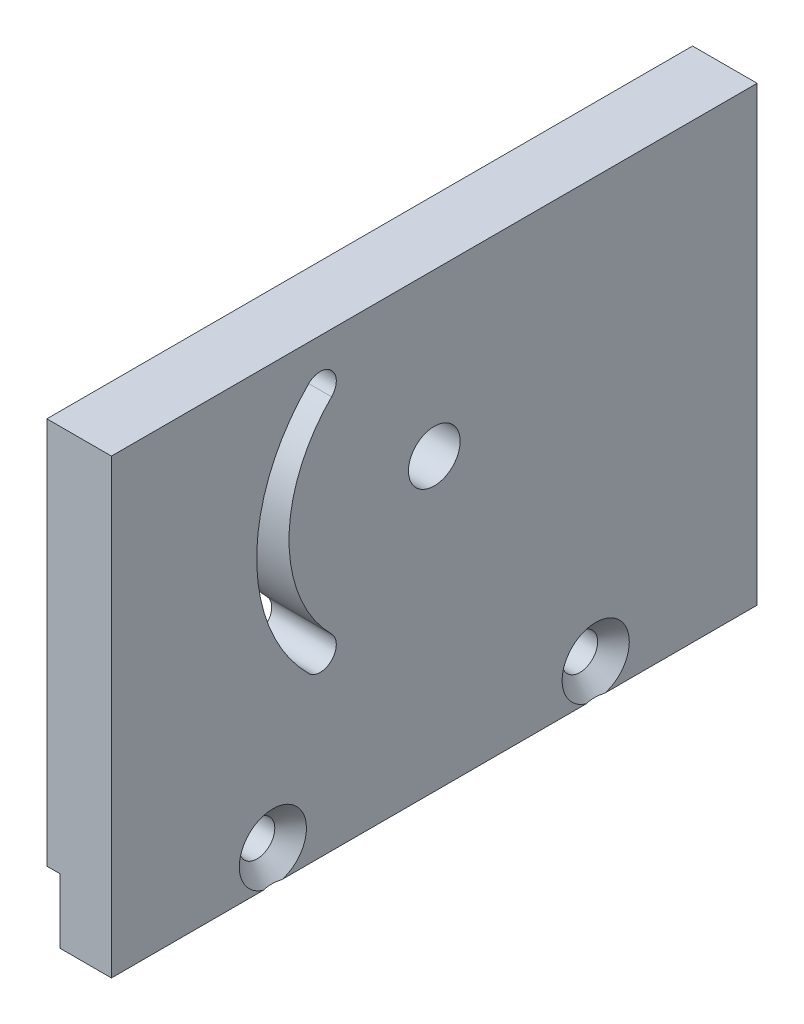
ISO-10303-21;
HEADER;
FILE_DESCRIPTION(('STEP AP214'),'2;1');
FILE_NAME('part.step','',(''),(''),'','','');
FILE_SCHEMA(('AUTOMOTIVE_DESIGN { 1 0 10303 214 1 1 1 1 }'));
ENDSEC;
DATA;
#1=APPLICATION_CONTEXT('core data for automotive mechanical design processes');
#2=APPLICATION_PROTOCOL_DEFINITION('international standard','automotive_design',2000,#1);
#3=PRODUCT_CONTEXT('',#1,'mechanical');
#4=PRODUCT('Part','Part','',(#3));
#5=PRODUCT_RELATED_PRODUCT_CATEGORY('part','',(#4));
#6=PRODUCT_DEFINITION_FORMATION('','',#4);
#7=PRODUCT_DEFINITION_CONTEXT('part definition',#1,'design');
#8=PRODUCT_DEFINITION('design','',#6,#7);
#9=PRODUCT_DEFINITION_SHAPE('','',#8);
#10=(LENGTH_UNIT() NAMED_UNIT(*) SI_UNIT(.MILLI.,.METRE.));
#11=(NAMED_UNIT(*) PLANE_ANGLE_UNIT() SI_UNIT($,.RADIAN.));
#12=(NAMED_UNIT(*) SI_UNIT($,.STERADIAN.) SOLID_ANGLE_UNIT());
#13=UNCERTAINTY_MEASURE_WITH_UNIT(LENGTH_MEASURE(1.E-05),#10,'distance_accuracy_value','');
#14=(GEOMETRIC_REPRESENTATION_CONTEXT(3) GLOBAL_UNCERTAINTY_ASSIGNED_CONTEXT((#13)) GLOBAL_UNIT_ASSIGNED_CONTEXT((#10,
#11,#12)) REPRESENTATION_CONTEXT('',''));
#15=CARTESIAN_POINT('',(0.,0.,0.));
#16=DIRECTION('',(0.,0.,1.));
#17=DIRECTION('',(1.,0.,0.));
#18=AXIS2_PLACEMENT_3D('',#15,#16,#17);
#19=CARTESIAN_POINT('',(70.,10.,-100.));
#20=DIRECTION('',(0.,-1.,0.));
#21=DIRECTION('',(0.,0.,-1.));
#22=AXIS2_PLACEMENT_3D('',#19,#20,#21);
#23=PLANE('',#22);
#24=DIRECTION('',(1.,0.,0.));
#25=VECTOR('',#24,1.);
#26=CARTESIAN_POINT('',(70.,10.,0.));
#27=LINE('',#26,#25);
#28=CARTESIAN_POINT('',(68.,10.,0.));
#29=VERTEX_POINT('',#28);
#30=CARTESIAN_POINT('',(70.,10.,0.));
#31=VERTEX_POINT('',#30);
#32=EDGE_CURVE('E195',#29,#31,#27,.T.);
#33=ORIENTED_EDGE('',*,*,#32,.F.);
#34=DIRECTION('',(0.,0.,1.));
#35=VECTOR('',#34,1.);
#36=CARTESIAN_POINT('',(68.,10.,-100.));
#37=LINE('',#36,#35);
#38=CARTESIAN_POINT('',(68.,10.,-100.));
#39=VERTEX_POINT('',#38);
#40=EDGE_CURVE('E212',#39,#29,#37,.T.);
#41=ORIENTED_EDGE('',*,*,#40,.F.);
#42=DIRECTION('',(1.,0.,0.));
#43=VECTOR('',#42,1.);
#44=CARTESIAN_POINT('',(70.,10.,-100.));
#45=LINE('',#44,#43);
#46=CARTESIAN_POINT('',(70.,10.,-100.));
#47=VERTEX_POINT('',#46);
#48=EDGE_CURVE('E175',#39,#47,#45,.T.);
#49=ORIENTED_EDGE('',*,*,#48,.T.);
#50=DIRECTION('',(0.,0.,1.));
#51=VECTOR('',#50,1.);
#52=CARTESIAN_POINT('',(70.,10.,-100.));
#53=LINE('',#52,#51);
#54=EDGE_CURVE('E194',#47,#31,#53,.T.);
#55=ORIENTED_EDGE('',*,*,#54,.T.);
#56=EDGE_LOOP('',(#33,#41,#49,#55));
#57=FACE_BOUND('',#56,.T.);
#58=ADVANCED_FACE('F34',(#57),#23,.T.);
#59=CARTESIAN_POINT('',(68.,10.,-100.));
#60=DIRECTION('',(-1.,0.,0.));
#61=DIRECTION('',(0.,0.,1.));
#62=AXIS2_PLACEMENT_3D('',#59,#60,#61);
#63=PLANE('',#62);
#64=CARTESIAN_POINT('',(68.,27.3223304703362,-32.3223304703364));
#65=DIRECTION('',(1.,0.,0.));
#66=DIRECTION('',(0.,1.,0.));
#67=AXIS2_PLACEMENT_3D('',#64,#65,#66);
#68=CIRCLE('',#67,2.5);
#69=CARTESIAN_POINT('',(68.,25.5545635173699,-30.55456351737));
#70=VERTEX_POINT('',#69);
#71=CARTESIAN_POINT('',(68.,29.0900974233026,-34.0900974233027));
#72=VERTEX_POINT('',#71);
#73=EDGE_CURVE('E124',#70,#72,#68,.T.);
#74=ORIENTED_EDGE('',*,*,#73,.T.);
#75=CARTESIAN_POINT('',(68.,45.,-50.));
#76=DIRECTION('',(-1.,0.,0.));
#77=DIRECTION('',(0.,1.,0.));
#78=AXIS2_PLACEMENT_3D('',#75,#76,#77);
#79=CIRCLE('',#78,22.5);
#80=CARTESIAN_POINT('',(68.,60.9099025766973,-34.0900974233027));
#81=VERTEX_POINT('',#80);
#82=EDGE_CURVE('E133',#72,#81,#79,.T.);
#83=ORIENTED_EDGE('',*,*,#82,.T.);
#84=CARTESIAN_POINT('',(68.,62.6776695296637,-32.3223304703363));
#85=DIRECTION('',(1.,0.,0.));
#86=DIRECTION('',(0.,1.,0.));
#87=AXIS2_PLACEMENT_3D('',#84,#85,#86);
#88=CIRCLE('',#87,2.5);
#89=CARTESIAN_POINT('',(68.,64.4454364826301,-30.55456351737));
#90=VERTEX_POINT('',#89);
#91=EDGE_CURVE('E49',#81,#90,#88,.T.);
#92=ORIENTED_EDGE('',*,*,#91,.T.);
#93=CARTESIAN_POINT('',(68.,45.,-50.));
#94=DIRECTION('',(1.,0.,0.));
#95=DIRECTION('',(0.,1.,0.));
#96=AXIS2_PLACEMENT_3D('',#93,#94,#95);
#97=CIRCLE('',#96,27.5);
#98=EDGE_CURVE('E130',#90,#70,#97,.T.);
#99=ORIENTED_EDGE('',*,*,#98,.T.);
#100=EDGE_LOOP('',(#74,#83,#92,#99));
#101=FACE_BOUND('',#100,.T.);
#102=CARTESIAN_POINT('',(68.,45.,-50.));
#103=DIRECTION('',(1.,0.,0.));
#104=DIRECTION('',(0.,1.,0.));
#105=AXIS2_PLACEMENT_3D('',#102,#103,#104);
#106=CIRCLE('',#105,4.00000000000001);
#107=CARTESIAN_POINT('',(68.,49.,-50.));
#108=VERTEX_POINT('',#107);
#109=EDGE_CURVE('E159',#108,#108,#106,.T.);
#110=ORIENTED_EDGE('',*,*,#109,.T.);
#111=EDGE_LOOP('',(#110));
#112=FACE_BOUND('',#111,.T.);
#113=DIRECTION('',(0.,-1.,0.));
#114=VECTOR('',#113,1.);
#115=CARTESIAN_POINT('',(68.,10.,0.));
#116=LINE('',#115,#114);
#117=CARTESIAN_POINT('',(68.,70.,0.));
#118=VERTEX_POINT('',#117);
#119=EDGE_CURVE('E179',#118,#29,#116,.T.);
#120=ORIENTED_EDGE('',*,*,#119,.F.);
#121=DIRECTION('',(0.,0.,1.));
#122=VECTOR('',#121,1.);
#123=CARTESIAN_POINT('',(68.,70.,-100.));
#124=LINE('',#123,#122);
#125=CARTESIAN_POINT('',(68.,70.,-100.));
#126=VERTEX_POINT('',#125);
#127=EDGE_CURVE('E214',#126,#118,#124,.T.);
#128=ORIENTED_EDGE('',*,*,#127,.F.);
#129=DIRECTION('',(0.,-1.,0.));
#130=VECTOR('',#129,1.);
#131=CARTESIAN_POINT('',(68.,10.,-100.));
#132=LINE('',#131,#130);
#133=EDGE_CURVE('E191',#126,#39,#132,.T.);
#134=ORIENTED_EDGE('',*,*,#133,.T.);
#135=ORIENTED_EDGE('',*,*,#40,.T.);
#136=EDGE_LOOP('',(#120,#128,#134,#135));
#137=FACE_BOUND('',#136,.T.);
#138=ADVANCED_FACE('F137',(#101,#112,#137),#63,.T.);
#139=CARTESIAN_POINT('',(68.,70.,-100.));
#140=DIRECTION('',(0.,1.,0.));
#141=DIRECTION('',(0.,0.,1.));
#142=AXIS2_PLACEMENT_3D('',#139,#140,#141);
#143=PLANE('',#142);
#144=DIRECTION('',(-1.,0.,0.));
#145=VECTOR('',#144,1.);
#146=CARTESIAN_POINT('',(68.,70.,0.));
#147=LINE('',#146,#145);
#148=CARTESIAN_POINT('',(78.,70.,0.));
#149=VERTEX_POINT('',#148);
#150=EDGE_CURVE('E207',#149,#118,#147,.T.);
#151=ORIENTED_EDGE('',*,*,#150,.F.);
#152=DIRECTION('',(0.,0.,1.));
#153=VECTOR('',#152,1.);
#154=CARTESIAN_POINT('',(78.,70.,-100.));
#155=LINE('',#154,#153);
#156=CARTESIAN_POINT('',(78.,70.,-100.));
#157=VERTEX_POINT('',#156);
#158=EDGE_CURVE('E216',#157,#149,#155,.T.);
#159=ORIENTED_EDGE('',*,*,#158,.F.);
#160=DIRECTION('',(-1.,0.,0.));
#161=VECTOR('',#160,1.);
#162=CARTESIAN_POINT('',(68.,70.,-100.));
#163=LINE('',#162,#161);
#164=EDGE_CURVE('E188',#157,#126,#163,.T.);
#165=ORIENTED_EDGE('',*,*,#164,.T.);
#166=ORIENTED_EDGE('',*,*,#127,.T.);
#167=EDGE_LOOP('',(#151,#159,#165,#166));
#168=FACE_BOUND('',#167,.T.);
#169=ADVANCED_FACE('F271',(#168),#143,.T.);
#170=CARTESIAN_POINT('',(78.,70.,-100.));
#171=DIRECTION('',(1.,0.,0.));
#172=DIRECTION('',(0.,1.,0.));
#173=AXIS2_PLACEMENT_3D('',#170,#171,#172);
#174=PLANE('',#173);
#175=CARTESIAN_POINT('',(78.,27.3223304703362,-32.3223304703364));
#176=DIRECTION('',(1.,0.,0.));
#177=DIRECTION('',(0.,1.,0.));
#178=AXIS2_PLACEMENT_3D('',#175,#176,#177);
#179=CIRCLE('',#178,2.5);
#180=CARTESIAN_POINT('',(78.,25.5545635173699,-30.55456351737));
#181=VERTEX_POINT('',#180);
#182=CARTESIAN_POINT('',(78.,29.0900974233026,-34.0900974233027));
#183=VERTEX_POINT('',#182);
#184=EDGE_CURVE('E57',#181,#183,#179,.T.);
#185=ORIENTED_EDGE('',*,*,#184,.F.);
#186=CARTESIAN_POINT('',(78.,45.,-50.));
#187=DIRECTION('',(1.,0.,0.));
#188=DIRECTION('',(0.,1.,0.));
#189=AXIS2_PLACEMENT_3D('',#186,#187,#188);
#190=CIRCLE('',#189,27.5);
#191=CARTESIAN_POINT('',(78.,64.4454364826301,-30.55456351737));
#192=VERTEX_POINT('',#191);
#193=EDGE_CURVE('E140',#192,#181,#190,.T.);
#194=ORIENTED_EDGE('',*,*,#193,.F.);
#195=CARTESIAN_POINT('',(78.,62.6776695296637,-32.3223304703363));
#196=DIRECTION('',(1.,0.,0.));
#197=DIRECTION('',(0.,1.,0.));
#198=AXIS2_PLACEMENT_3D('',#195,#196,#197);
#199=CIRCLE('',#198,2.5);
#200=CARTESIAN_POINT('',(78.,60.9099025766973,-34.0900974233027));
#201=VERTEX_POINT('',#200);
#202=EDGE_CURVE('E143',#201,#192,#199,.T.);
#203=ORIENTED_EDGE('',*,*,#202,.F.);
#204=CARTESIAN_POINT('',(78.,45.,-50.));
#205=DIRECTION('',(-1.,0.,0.));
#206=DIRECTION('',(0.,1.,0.));
#207=AXIS2_PLACEMENT_3D('',#204,#205,#206);
#208=CIRCLE('',#207,22.5);
#209=EDGE_CURVE('E149',#183,#201,#208,.T.);
#210=ORIENTED_EDGE('',*,*,#209,.F.);
#211=EDGE_LOOP('',(#185,#194,#203,#210));
#212=FACE_BOUND('',#211,.T.);
#213=CARTESIAN_POINT('',(78.,45.,-50.));
#214=DIRECTION('',(1.,0.,0.));
#215=DIRECTION('',(0.,1.,0.));
#216=AXIS2_PLACEMENT_3D('',#213,#214,#215);
#217=CIRCLE('',#216,4.00000000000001);
#218=CARTESIAN_POINT('',(78.,49.,-50.));
#219=VERTEX_POINT('',#218);
#220=EDGE_CURVE('E155',#219,#219,#217,.T.);
#221=ORIENTED_EDGE('',*,*,#220,.F.);
#222=EDGE_LOOP('',(#221));
#223=FACE_BOUND('',#222,.T.);
#224=CARTESIAN_POINT('',(78.,5.,-25.));
#225=DIRECTION('',(1.,0.,0.));
#226=DIRECTION('',(0.,0.,-1.));
#227=AXIS2_PLACEMENT_3D('',#224,#225,#226);
#228=CIRCLE('',#227,5.2);
#229=CARTESIAN_POINT('',(78.,0.,-26.4282856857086));
#230=VERTEX_POINT('',#229);
#231=CARTESIAN_POINT('',(78.,0.,-23.5717143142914));
#232=VERTEX_POINT('',#231);
#233=EDGE_CURVE('E162',#230,#232,#228,.T.);
#234=ORIENTED_EDGE('',*,*,#233,.F.);
#235=DIRECTION('',(0.,0.,1.));
#236=VECTOR('',#235,1.);
#237=CARTESIAN_POINT('',(78.,0.,-100.));
#238=LINE('',#237,#236);
#239=CARTESIAN_POINT('',(78.,0.,-73.5717143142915));
#240=VERTEX_POINT('',#239);
#241=EDGE_CURVE('E221',#240,#230,#238,.T.);
#242=ORIENTED_EDGE('',*,*,#241,.F.);
#243=CARTESIAN_POINT('',(78.,5.,-75.));
#244=DIRECTION('',(1.,0.,0.));
#245=DIRECTION('',(0.,0.,-1.));
#246=AXIS2_PLACEMENT_3D('',#243,#244,#245);
#247=CIRCLE('',#246,5.2);
#248=CARTESIAN_POINT('',(78.,0.,-76.4282856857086));
#249=VERTEX_POINT('',#248);
#250=EDGE_CURVE('E169',#249,#240,#247,.T.);
#251=ORIENTED_EDGE('',*,*,#250,.F.);
#252=CARTESIAN_POINT('',(78.,0.,-100.));
#253=VERTEX_POINT('',#252);
#254=EDGE_CURVE('E218',#253,#249,#238,.T.);
#255=ORIENTED_EDGE('',*,*,#254,.F.);
#256=DIRECTION('',(0.,1.,0.));
#257=VECTOR('',#256,1.);
#258=CARTESIAN_POINT('',(78.,70.,-100.));
#259=LINE('',#258,#257);
#260=EDGE_CURVE('E185',#253,#157,#259,.T.);
#261=ORIENTED_EDGE('',*,*,#260,.T.);
#262=ORIENTED_EDGE('',*,*,#158,.T.);
#263=DIRECTION('',(0.,1.,0.));
#264=VECTOR('',#263,1.);
#265=CARTESIAN_POINT('',(78.,70.,0.));
#266=LINE('',#265,#264);
#267=CARTESIAN_POINT('',(78.,0.,0.));
#268=VERTEX_POINT('',#267);
#269=EDGE_CURVE('E204',#268,#149,#266,.T.);
#270=ORIENTED_EDGE('',*,*,#269,.F.);
#271=EDGE_CURVE('E222',#232,#268,#238,.T.);
#272=ORIENTED_EDGE('',*,*,#271,.F.);
#273=EDGE_LOOP('',(#234,#242,#251,#255,#261,#262,#270,#272));
#274=FACE_BOUND('',#273,.T.);
#275=ADVANCED_FACE('F241',(#212,#223,#274),#174,.T.);
#276=CARTESIAN_POINT('',(78.,0.,-100.));
#277=DIRECTION('',(0.,-1.,0.));
#278=DIRECTION('',(0.,0.,-1.));
#279=AXIS2_PLACEMENT_3D('',#276,#277,#278);
#280=PLANE('',#279);
#281=CARTESIAN_POINT('',(90.6549461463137,0.,-42.1405688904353));
#282=CARTESIAN_POINT('',(90.247245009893,0.,-41.715837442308));
#283=CARTESIAN_POINT('',(89.8401244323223,0.,-41.2905461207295));
#284=CARTESIAN_POINT('',(89.0274201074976,0.,-40.4384551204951));
#285=CARTESIAN_POINT('',(88.621836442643,0.,-40.0116553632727));
#286=CARTESIAN_POINT('',(87.8115046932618,0.,-39.1550195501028));
#287=CARTESIAN_POINT('',(87.4067620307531,0.,-38.7251783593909));
#288=CARTESIAN_POINT('',(86.5998676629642,0.,-37.863101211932));
#289=CARTESIAN_POINT('',(86.197715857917,0.,-37.4308653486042));
#290=CARTESIAN_POINT('',(85.3490700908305,0.,-36.5114852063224));
#291=CARTESIAN_POINT('',(84.9030082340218,0.,-36.0239407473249));
#292=CARTESIAN_POINT('',(84.2385324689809,0.,-35.2883897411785));
#293=CARTESIAN_POINT('',(84.0177946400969,0.,-35.0424828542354));
#294=CARTESIAN_POINT('',(83.5782281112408,0.,-34.5489697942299));
#295=CARTESIAN_POINT('',(83.3593993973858,0.,-34.3013636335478));
#296=CARTESIAN_POINT('',(82.9244510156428,0.,-33.8044826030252));
#297=CARTESIAN_POINT('',(82.7083275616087,0.,-33.5552110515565));
#298=CARTESIAN_POINT('',(82.2790457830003,0.,-33.0541310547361));
#299=CARTESIAN_POINT('',(82.0658874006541,0.,-32.8023226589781));
#300=CARTESIAN_POINT('',(81.643415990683,0.,-32.2955867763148));
#301=CARTESIAN_POINT('',(81.4341021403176,0.,-32.0406599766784));
#302=CARTESIAN_POINT('',(81.0204556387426,0.,-31.5268054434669));
#303=CARTESIAN_POINT('',(80.816122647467,0.,-31.2678779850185));
#304=CARTESIAN_POINT('',(80.4864100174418,0.,-30.8388641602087));
#305=CARTESIAN_POINT('',(80.3590520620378,0.,-30.6702994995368));
#306=CARTESIAN_POINT('',(80.107719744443,0.,-30.3306506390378));
#307=CARTESIAN_POINT('',(79.9837454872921,0.,-30.1595663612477));
#308=CARTESIAN_POINT('',(79.7397826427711,0.,-29.8141013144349));
#309=CARTESIAN_POINT('',(79.619801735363,0.,-29.6397151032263));
#310=CARTESIAN_POINT('',(79.3851670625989,0.,-29.2873890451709));
#311=CARTESIAN_POINT('',(79.2705130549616,0.,-29.1094493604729));
#312=CARTESIAN_POINT('',(79.0502699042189,0.,-28.7530138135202));
#313=CARTESIAN_POINT('',(78.9445436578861,0.,-28.5746031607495));
#314=CARTESIAN_POINT('',(78.7414541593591,0.,-28.2129842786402));
#315=CARTESIAN_POINT('',(78.6440929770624,0.,-28.0297748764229));
#316=CARTESIAN_POINT('',(78.4605376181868,0.,-27.6585047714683));
#317=CARTESIAN_POINT('',(78.374309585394,0.,-27.4704609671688));
#318=CARTESIAN_POINT('',(78.2159134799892,0.,-27.0885962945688));
#319=CARTESIAN_POINT('',(78.1437342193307,0.,-26.8947801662));
#320=CARTESIAN_POINT('',(78.0405016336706,0.,-26.5737570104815));
#321=CARTESIAN_POINT('',(78.0040867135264,0.,-26.4482721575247));
#322=CARTESIAN_POINT('',(77.9394064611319,0.,-26.1951822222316));
#323=CARTESIAN_POINT('',(77.911141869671,0.,-26.0675769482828));
#324=CARTESIAN_POINT('',(77.8637825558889,0.,-25.8110095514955));
#325=CARTESIAN_POINT('',(77.8446635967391,0.,-25.682051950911));
#326=CARTESIAN_POINT('',(77.8162150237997,0.,-25.4230628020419));
#327=CARTESIAN_POINT('',(77.8068848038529,0.,-25.2930313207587));
#328=CARTESIAN_POINT('',(77.7975090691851,0.,-25.0047245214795));
#329=CARTESIAN_POINT('',(77.7998796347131,0.,-24.8463637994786));
#330=CARTESIAN_POINT('',(77.8195120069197,0.,-24.5305720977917));
#331=CARTESIAN_POINT('',(77.8367759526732,0.,-24.3731412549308));
#332=CARTESIAN_POINT('',(77.8852616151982,0.,-24.0598089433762));
#333=CARTESIAN_POINT('',(77.9165405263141,0.,-23.9039164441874));
#334=CARTESIAN_POINT('',(77.9914455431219,0.,-23.5951683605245));
#335=CARTESIAN_POINT('',(78.0350731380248,0.,-23.4423131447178));
#336=CARTESIAN_POINT('',(78.1810262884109,0.,-22.9909544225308));
#337=CARTESIAN_POINT('',(78.2988179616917,0.,-22.6974212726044));
#338=CARTESIAN_POINT('',(78.4966944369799,0.,-22.2671339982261));
#339=CARTESIAN_POINT('',(78.5662646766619,0.,-22.1252372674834));
#340=CARTESIAN_POINT('',(78.7112584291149,0.,-21.8444604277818));
#341=CARTESIAN_POINT('',(78.7866811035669,0.,-21.7055798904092));
#342=CARTESIAN_POINT('',(78.9434253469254,0.,-21.4286000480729));
#343=CARTESIAN_POINT('',(79.0248155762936,0.,-21.2905399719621));
#344=CARTESIAN_POINT('',(79.1916607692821,0.,-21.0169002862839));
#345=CARTESIAN_POINT('',(79.2771158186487,0.,-20.881320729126));
#346=CARTESIAN_POINT('',(79.45131623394,0.,-20.6124622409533));
#347=CARTESIAN_POINT('',(79.540058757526,0.,-20.4791814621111));
#348=CARTESIAN_POINT('',(79.7203488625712,0.,-20.2145445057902));
#349=CARTESIAN_POINT('',(79.8118963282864,0.,-20.0831882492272));
#350=CARTESIAN_POINT('',(80.1175839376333,0.,-19.6528731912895));
#351=CARTESIAN_POINT('',(80.3367415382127,0.,-19.3574773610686));
#352=CARTESIAN_POINT('',(80.7835971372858,0.,-18.7731960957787));
#353=CARTESIAN_POINT('',(81.0112967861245,0.,-18.4843119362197));
#354=CARTESIAN_POINT('',(81.4729776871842,0.,-17.9113238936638));
#355=CARTESIAN_POINT('',(81.7069627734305,0.,-17.6272231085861));
#356=CARTESIAN_POINT('',(82.1794642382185,0.,-17.0628646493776));
#357=CARTESIAN_POINT('',(82.417980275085,0.,-16.7826066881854));
#358=CARTESIAN_POINT('',(82.8991141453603,0.,-16.2243414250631));
#359=CARTESIAN_POINT('',(83.1417411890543,0.,-15.9463420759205));
#360=CARTESIAN_POINT('',(83.6297074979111,0.,-15.3927297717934));
#361=CARTESIAN_POINT('',(83.8750468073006,0.,-15.1171168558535));
#362=CARTESIAN_POINT('',(84.3677841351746,0.,-14.5679183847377));
#363=CARTESIAN_POINT('',(84.6151813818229,0.,-14.2943321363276));
#364=CARTESIAN_POINT('',(85.1117091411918,0.,-13.7487362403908));
#365=CARTESIAN_POINT('',(85.3608396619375,0.,-13.4767266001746));
#366=CARTESIAN_POINT('',(86.0491967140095,0.,-12.729061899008));
#367=CARTESIAN_POINT('',(86.4898897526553,0.,-12.2547573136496));
#368=CARTESIAN_POINT('',(87.3744535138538,0.,-11.3090345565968));
#369=CARTESIAN_POINT('',(87.8183245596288,0.,-10.8376166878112));
#370=CARTESIAN_POINT('',(88.706228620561,0.,-9.89930095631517));
#371=CARTESIAN_POINT('',(89.1502502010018,0.,-9.43239226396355));
#372=CARTESIAN_POINT('',(90.0400506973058,0.,-8.5003609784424));
#373=CARTESIAN_POINT('',(90.485829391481,0.,-8.03523817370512));
#374=CARTESIAN_POINT('',(90.9322606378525,0.,-7.57074654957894));
#375=B_SPLINE_CURVE_WITH_KNOTS('',3,(#281,#282,#283,#284,#285,#286,#287,#288,#289,#290,#291,
#292,#293,#294,#295,#296,#297,#298,#299,#300,#301,#302,#303,#304,#305,#306,#307,#308,#309,#310,
#311,#312,#313,#314,#315,#316,#317,#318,#319,#320,#321,#322,#323,#324,#325,#326,#327,#328,#329,
#330,#331,#332,#333,#334,#335,#336,#337,#338,#339,#340,#341,#342,#343,#344,#345,#346,#347,#348,
#349,#350,#351,#352,#353,#354,#355,#356,#357,#358,#359,#360,#361,#362,#363,#364,#365,#366,#367,
#368,#369,#370,#371,#372,#373,#374),.UNSPECIFIED.,.F.,.F.,(4,2,2,2,2,2,2,2,2,2,2,2,2,2,2,2,2,2,
2,2,2,2,2,2,2,2,2,2,2,2,2,2,2,2,2,2,2,2,2,2,2,2,2,2,2,2,4),(0.,1.7662278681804,3.5325491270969,
5.303760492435,7.0749032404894,9.05729193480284,10.0486261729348,11.039953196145,
12.0296882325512,13.0194039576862,14.0089053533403,14.9983390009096,15.6321095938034,
16.2658998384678,16.9008457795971,17.5357628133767,18.1577428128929,18.7798762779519,
19.4000708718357,20.019769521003,20.4115253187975,20.8033167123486,21.1940639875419,
21.5847870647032,22.05917980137,22.53364068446,23.0100557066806,23.4865282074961,
24.4327241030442,24.9067676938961,25.3807435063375,25.8614629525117,26.3421925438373,
26.8225157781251,27.3028192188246,28.4060062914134,29.5094076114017,30.6134979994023,
31.7175054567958,32.8244445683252,33.9314017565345,35.037960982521,36.144525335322,
38.0868153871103,40.0293058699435,41.9622851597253,43.8950279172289),.UNSPECIFIED.);
#376=EDGE_CURVE('E11',#232,#230,#375,.F.);
#377=ORIENTED_EDGE('',*,*,#376,.F.);
#378=ORIENTED_EDGE('',*,*,#271,.T.);
#379=DIRECTION('',(1.,0.,0.));
#380=VECTOR('',#379,1.);
#381=CARTESIAN_POINT('',(78.,0.,0.));
#382=LINE('',#381,#380);
#383=CARTESIAN_POINT('',(70.,0.,0.));
#384=VERTEX_POINT('',#383);
#385=EDGE_CURVE('E201',#384,#268,#382,.T.);
#386=ORIENTED_EDGE('',*,*,#385,.F.);
#387=DIRECTION('',(0.,0.,1.));
#388=VECTOR('',#387,1.);
#389=CARTESIAN_POINT('',(70.,0.,-100.));
#390=LINE('',#389,#388);
#391=CARTESIAN_POINT('',(70.,0.,-100.));
#392=VERTEX_POINT('',#391);
#393=EDGE_CURVE('E223',#392,#384,#390,.T.);
#394=ORIENTED_EDGE('',*,*,#393,.F.);
#395=DIRECTION('',(1.,0.,0.));
#396=VECTOR('',#395,1.);
#397=CARTESIAN_POINT('',(78.,0.,-100.));
#398=LINE('',#397,#396);
#399=EDGE_CURVE('E182',#392,#253,#398,.T.);
#400=ORIENTED_EDGE('',*,*,#399,.T.);
#401=ORIENTED_EDGE('',*,*,#254,.T.);
#402=CARTESIAN_POINT('',(90.6549461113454,0.,-92.1405688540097));
#403=CARTESIAN_POINT('',(90.2472449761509,0.,-91.7158374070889));
#404=CARTESIAN_POINT('',(89.8401243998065,0.,-91.2905460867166));
#405=CARTESIAN_POINT('',(89.0274200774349,0.,-90.438455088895));
#406=CARTESIAN_POINT('',(88.6218364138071,0.,-90.0116553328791));
#407=CARTESIAN_POINT('',(87.8115046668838,0.,-89.1550195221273));
#408=CARTESIAN_POINT('',(87.4067620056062,0.,-88.7251783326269));
#409=CARTESIAN_POINT('',(86.5998676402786,0.,-87.8631011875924));
#410=CARTESIAN_POINT('',(86.1977158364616,0.,-87.4308653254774));
#411=CARTESIAN_POINT('',(85.3490700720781,0.,-86.5114851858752));
#412=CARTESIAN_POINT('',(84.9030082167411,0.,-86.0239407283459));
#413=CARTESIAN_POINT('',(84.2385324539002,0.,-85.2883897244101));
#414=CARTESIAN_POINT('',(84.0177946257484,0.,-85.0424828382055));
#415=CARTESIAN_POINT('',(83.5782280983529,0.,-84.5489697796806));
#416=CARTESIAN_POINT('',(83.3593993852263,0.,-84.3013636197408));
#417=CARTESIAN_POINT('',(82.9244510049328,0.,-83.8044825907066));
#418=CARTESIAN_POINT('',(82.7083275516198,0.,-83.5552110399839));
#419=CARTESIAN_POINT('',(82.2790457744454,0.,-83.0541310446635));
#420=CARTESIAN_POINT('',(82.065887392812,0.,-82.8023226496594));
#421=CARTESIAN_POINT('',(81.6434159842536,0.,-82.2955867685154));
#422=CARTESIAN_POINT('',(81.4341021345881,0.,-82.0406599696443));
#423=CARTESIAN_POINT('',(81.0204556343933,0.,-81.5268054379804));
#424=CARTESIAN_POINT('',(80.816122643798,0.,-81.2678779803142));
#425=CARTESIAN_POINT('',(80.4864100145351,0.,-80.8388641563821));
#426=CARTESIAN_POINT('',(80.3590520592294,0.,-80.6702994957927));
#427=CARTESIAN_POINT('',(80.1077197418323,0.,-80.3306506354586));
#428=CARTESIAN_POINT('',(79.9837454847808,0.,-80.1595663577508));
#429=CARTESIAN_POINT('',(79.7397826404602,0.,-79.8141013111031));
#430=CARTESIAN_POINT('',(79.6198017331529,0.,-79.6397150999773));
#431=CARTESIAN_POINT('',(79.385167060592,0.,-79.2873890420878));
#432=CARTESIAN_POINT('',(79.2705130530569,0.,-79.109449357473));
#433=CARTESIAN_POINT('',(79.0502699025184,0.,-78.7530138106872));
#434=CARTESIAN_POINT('',(78.9445436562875,0.,-78.5746031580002));
#435=CARTESIAN_POINT('',(78.741454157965,0.,-78.2129842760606));
#436=CARTESIAN_POINT('',(78.6440929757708,0.,-78.0297748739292));
#437=CARTESIAN_POINT('',(78.4605376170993,0.,-77.6585047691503));
#438=CARTESIAN_POINT('',(78.3743095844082,0.,-77.4704609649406));
#439=CARTESIAN_POINT('',(78.2159134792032,0.,-77.0885962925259));
#440=CARTESIAN_POINT('',(78.1437342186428,0.,-76.8947801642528));
#441=CARTESIAN_POINT('',(78.040501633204,0.,-76.5737570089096));
#442=CARTESIAN_POINT('',(78.0040867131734,0.,-76.4482721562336));
#443=CARTESIAN_POINT('',(77.9394064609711,0.,-76.1951822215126));
#444=CARTESIAN_POINT('',(77.9111418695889,0.,-76.0675769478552));
#445=CARTESIAN_POINT('',(77.8637825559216,0.,-75.8110095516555));
#446=CARTESIAN_POINT('',(77.8446635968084,0.,-75.6820519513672));
#447=CARTESIAN_POINT('',(77.816215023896,0.,-75.423062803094));
#448=CARTESIAN_POINT('',(77.8068848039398,0.,-75.2930313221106));
#449=CARTESIAN_POINT('',(77.7975090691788,0.,-75.0047245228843));
#450=CARTESIAN_POINT('',(77.7998796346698,0.,-74.8463638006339));
#451=CARTESIAN_POINT('',(77.8195120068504,0.,-74.5305720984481));
#452=CARTESIAN_POINT('',(77.836775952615,0.,-74.3731412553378));
#453=CARTESIAN_POINT('',(77.885261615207,0.,-74.059808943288));
#454=CARTESIAN_POINT('',(77.916540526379,0.,-73.9039164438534));
#455=CARTESIAN_POINT('',(77.9914455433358,0.,-73.5951683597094));
#456=CARTESIAN_POINT('',(78.0350731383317,0.,-73.4423131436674));
#457=CARTESIAN_POINT('',(78.1810262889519,0.,-72.9909544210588));
#458=CARTESIAN_POINT('',(78.2988179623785,0.,-72.6974212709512));
#459=CARTESIAN_POINT('',(78.4966944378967,0.,-72.2671339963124));
#460=CARTESIAN_POINT('',(78.5662646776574,0.,-72.1252372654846));
#461=CARTESIAN_POINT('',(78.7112584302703,0.,-71.8444604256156));
#462=CARTESIAN_POINT('',(78.7866811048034,0.,-71.7055798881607));
#463=CARTESIAN_POINT('',(78.9434253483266,0.,-71.4286000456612));
#464=CARTESIAN_POINT('',(79.0248155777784,0.,-71.2905399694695));
#465=CARTESIAN_POINT('',(79.1916607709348,0.,-71.0169002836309));
#466=CARTESIAN_POINT('',(79.2771158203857,0.,-70.8813207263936));
#467=CARTESIAN_POINT('',(79.4513162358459,0.,-70.6124622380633));
#468=CARTESIAN_POINT('',(79.5400587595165,0.,-70.4791814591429));
#469=CARTESIAN_POINT('',(79.720348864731,0.,-70.2145445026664));
#470=CARTESIAN_POINT('',(79.8118963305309,0.,-70.0831882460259));
#471=CARTESIAN_POINT('',(80.1175839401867,0.,-69.6528731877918));
#472=CARTESIAN_POINT('',(80.3367415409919,0.,-69.3574773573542));
#473=CARTESIAN_POINT('',(80.7835971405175,0.,-68.7731960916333));
#474=CARTESIAN_POINT('',(81.0112967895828,0.,-68.4843119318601));
#475=CARTESIAN_POINT('',(81.4729776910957,0.,-67.9113238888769));
#476=CARTESIAN_POINT('',(81.7069627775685,0.,-67.6272231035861));
#477=CARTESIAN_POINT('',(82.1794642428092,0.,-67.0628646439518));
#478=CARTESIAN_POINT('',(82.4179802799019,0.,-66.782606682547));
#479=CARTESIAN_POINT('',(82.8991141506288,0.,-66.2243414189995));
#480=CARTESIAN_POINT('',(83.1417411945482,0.,-65.9463420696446));
#481=CARTESIAN_POINT('',(83.6297075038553,0.,-65.3927297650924));
#482=CARTESIAN_POINT('',(83.8750468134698,0.,-65.1171168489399));
#483=CARTESIAN_POINT('',(84.3677841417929,0.,-64.5679183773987));
#484=CARTESIAN_POINT('',(84.6151813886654,0.,-64.2943321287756));
#485=CARTESIAN_POINT('',(85.1117091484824,0.,-63.7487362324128));
#486=CARTESIAN_POINT('',(85.3608396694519,0.,-63.4767265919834));
#487=CARTESIAN_POINT('',(86.0491967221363,0.,-62.7290618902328));
#488=CARTESIAN_POINT('',(86.4898897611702,0.,-62.2547573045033));
#489=CARTESIAN_POINT('',(87.3744535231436,0.,-61.3090345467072));
#490=CARTESIAN_POINT('',(87.8183245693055,0.,-60.8376166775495));
#491=CARTESIAN_POINT('',(88.7062286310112,0.,-59.8993009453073));
#492=CARTESIAN_POINT('',(89.1502502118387,0.,-59.4323922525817));
#493=CARTESIAN_POINT('',(90.0400507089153,0.,-58.5003609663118));
#494=CARTESIAN_POINT('',(90.4858294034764,0.,-58.0352381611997));
#495=CARTESIAN_POINT('',(90.9322606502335,0.,-57.5707465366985));
#496=B_SPLINE_CURVE_WITH_KNOTS('',3,(#402,#403,#404,#405,#406,#407,#408,#409,#410,#411,#412,
#413,#414,#415,#416,#417,#418,#419,#420,#421,#422,#423,#424,#425,#426,#427,#428,#429,#430,#431,
#432,#433,#434,#435,#436,#437,#438,#439,#440,#441,#442,#443,#444,#445,#446,#447,#448,#449,#450,
#451,#452,#453,#454,#455,#456,#457,#458,#459,#460,#461,#462,#463,#464,#465,#466,#467,#468,#469,
#470,#471,#472,#473,#474,#475,#476,#477,#478,#479,#480,#481,#482,#483,#484,#485,#486,#487,#488,
#489,#490,#491,#492,#493,#494,#495),.UNSPECIFIED.,.F.,.F.,(4,2,2,2,2,2,2,2,2,2,2,2,2,2,2,2,2,2,
2,2,2,2,2,2,2,2,2,2,2,2,2,2,2,2,2,2,2,2,2,2,2,2,2,2,2,2,4),(0.,1.76622786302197,3.5325491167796,
5.30376047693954,7.07490321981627,9.05729190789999,10.0486261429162,11.0399531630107,
12.0296881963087,13.0194039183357,14.0089053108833,14.9983389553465,15.6321095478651,
16.2658997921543,16.9008457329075,17.5357627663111,18.1577427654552,18.7798762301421,
19.4000708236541,20.0197694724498,20.4115252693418,20.8033166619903,21.194063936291,
21.5847870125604,22.0591797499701,22.5336406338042,23.0100556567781,23.4865281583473,
24.4327240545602,24.9067676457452,25.3807434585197,25.8614629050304,26.3421924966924,
26.8225157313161,27.3028191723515,28.4060062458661,29.5094075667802,30.6134979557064,
31.7175054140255,32.8244445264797,33.931401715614,35.0379609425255,36.1445252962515,
38.0868153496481,40.0293058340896,41.9622851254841,43.8950278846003),.UNSPECIFIED.);
#497=EDGE_CURVE('E42',#240,#249,#496,.F.);
#498=ORIENTED_EDGE('',*,*,#497,.F.);
#499=ORIENTED_EDGE('',*,*,#241,.T.);
#500=EDGE_LOOP('',(#377,#378,#386,#394,#400,#401,#498,#499));
#501=FACE_BOUND('',#500,.T.);
#502=ADVANCED_FACE('F236',(#501),#280,.T.);
#503=CARTESIAN_POINT('',(70.,0.,-100.));
#504=DIRECTION('',(-1.,0.,0.));
#505=DIRECTION('',(0.,0.,1.));
#506=AXIS2_PLACEMENT_3D('',#503,#504,#505);
#507=PLANE('',#506);
#508=CARTESIAN_POINT('',(70.,5.,-25.));
#509=DIRECTION('',(-1.,0.,0.));
#510=DIRECTION('',(0.,0.,1.));
#511=AXIS2_PLACEMENT_3D('',#508,#509,#510);
#512=CIRCLE('',#511,2.75);
#513=CARTESIAN_POINT('',(70.,5.,-22.25));
#514=VERTEX_POINT('',#513);
#515=EDGE_CURVE('E37',#514,#514,#512,.T.);
#516=ORIENTED_EDGE('',*,*,#515,.F.);
#517=EDGE_LOOP('',(#516));
#518=FACE_BOUND('',#517,.T.);
#519=CARTESIAN_POINT('',(70.,5.,-75.));
#520=DIRECTION('',(-1.,0.,0.));
#521=DIRECTION('',(0.,0.,1.));
#522=AXIS2_PLACEMENT_3D('',#519,#520,#521);
#523=CIRCLE('',#522,2.75);
#524=CARTESIAN_POINT('',(70.,5.,-72.25));
#525=VERTEX_POINT('',#524);
#526=EDGE_CURVE('E174',#525,#525,#523,.T.);
#527=ORIENTED_EDGE('',*,*,#526,.F.);
#528=EDGE_LOOP('',(#527));
#529=FACE_BOUND('',#528,.T.);
#530=DIRECTION('',(0.,-1.,0.));
#531=VECTOR('',#530,1.);
#532=CARTESIAN_POINT('',(70.,0.,0.));
#533=LINE('',#532,#531);
#534=EDGE_CURVE('E198',#31,#384,#533,.T.);
#535=ORIENTED_EDGE('',*,*,#534,.F.);
#536=ORIENTED_EDGE('',*,*,#54,.F.);
#537=DIRECTION('',(0.,-1.,0.));
#538=VECTOR('',#537,1.);
#539=CARTESIAN_POINT('',(70.,0.,-100.));
#540=LINE('',#539,#538);
#541=EDGE_CURVE('E178',#47,#392,#540,.T.);
#542=ORIENTED_EDGE('',*,*,#541,.T.);
#543=ORIENTED_EDGE('',*,*,#393,.T.);
#544=EDGE_LOOP('',(#535,#536,#542,#543));
#545=FACE_BOUND('',#544,.T.);
#546=ADVANCED_FACE('F240',(#518,#529,#545),#507,.T.);
#547=CARTESIAN_POINT('',(0.,0.,-100.));
#548=DIRECTION('',(0.,0.,-1.));
#549=DIRECTION('',(-1.,0.,0.));
#550=AXIS2_PLACEMENT_3D('',#547,#548,#549);
#551=PLANE('',#550);
#552=ORIENTED_EDGE('',*,*,#48,.F.);
#553=ORIENTED_EDGE('',*,*,#133,.F.);
#554=ORIENTED_EDGE('',*,*,#164,.F.);
#555=ORIENTED_EDGE('',*,*,#260,.F.);
#556=ORIENTED_EDGE('',*,*,#399,.F.);
#557=ORIENTED_EDGE('',*,*,#541,.F.);
#558=EDGE_LOOP('',(#552,#553,#554,#555,#556,#557));
#559=FACE_BOUND('',#558,.T.);
#560=ADVANCED_FACE('F284',(#559),#551,.T.);
#561=CARTESIAN_POINT('',(0.,0.,0.));
#562=DIRECTION('',(0.,0.,-1.));
#563=DIRECTION('',(-1.,0.,0.));
#564=AXIS2_PLACEMENT_3D('',#561,#562,#563);
#565=PLANE('',#564);
#566=ORIENTED_EDGE('',*,*,#32,.T.);
#567=ORIENTED_EDGE('',*,*,#534,.T.);
#568=ORIENTED_EDGE('',*,*,#385,.T.);
#569=ORIENTED_EDGE('',*,*,#269,.T.);
#570=ORIENTED_EDGE('',*,*,#150,.T.);
#571=ORIENTED_EDGE('',*,*,#119,.T.);
#572=EDGE_LOOP('',(#566,#567,#568,#569,#570,#571));
#573=FACE_BOUND('',#572,.T.);
#574=ADVANCED_FACE('F278',(#573),#565,.F.);
#575=CARTESIAN_POINT('',(78.,5.,-75.));
#576=DIRECTION('',(1.,0.,0.));
#577=DIRECTION('',(0.,0.,-1.));
#578=AXIS2_PLACEMENT_3D('',#575,#576,#577);
#579=CYLINDRICAL_SURFACE('',#578,2.75);
#580=ORIENTED_EDGE('',*,*,#526,.T.);
#581=EDGE_LOOP('',(#580));
#582=FACE_BOUND('',#581,.T.);
#583=CARTESIAN_POINT('',(75.55,5.,-75.));
#584=DIRECTION('',(1.,0.,0.));
#585=DIRECTION('',(0.,0.,-1.));
#586=AXIS2_PLACEMENT_3D('',#583,#584,#585);
#587=CIRCLE('',#586,2.75);
#588=CARTESIAN_POINT('',(75.55,5.,-77.75));
#589=VERTEX_POINT('',#588);
#590=EDGE_CURVE('E171',#589,#589,#587,.T.);
#591=ORIENTED_EDGE('',*,*,#590,.T.);
#592=EDGE_LOOP('',(#591));
#593=FACE_BOUND('',#592,.T.);
#594=ADVANCED_FACE('F262',(#582,#593),#579,.F.);
#595=CARTESIAN_POINT('',(78.,5.,-75.));
#596=DIRECTION('',(1.,0.,0.));
#597=DIRECTION('',(0.,0.,-1.));
#598=AXIS2_PLACEMENT_3D('',#595,#596,#597);
#599=CONICAL_SURFACE('',#598,5.2,0.785398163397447);
#600=ORIENTED_EDGE('',*,*,#497,.T.);
#601=ORIENTED_EDGE('',*,*,#250,.T.);
#602=EDGE_LOOP('',(#600,#601));
#603=FACE_BOUND('',#602,.T.);
#604=ORIENTED_EDGE('',*,*,#590,.F.);
#605=EDGE_LOOP('',(#604));
#606=FACE_BOUND('',#605,.T.);
#607=ADVANCED_FACE('F232',(#603,#606),#599,.F.);
#608=CARTESIAN_POINT('',(78.,5.,-25.));
#609=DIRECTION('',(1.,0.,0.));
#610=DIRECTION('',(0.,0.,-1.));
#611=AXIS2_PLACEMENT_3D('',#608,#609,#610);
#612=CYLINDRICAL_SURFACE('',#611,2.75);
#613=ORIENTED_EDGE('',*,*,#515,.T.);
#614=EDGE_LOOP('',(#613));
#615=FACE_BOUND('',#614,.T.);
#616=CARTESIAN_POINT('',(75.55,5.,-25.));
#617=DIRECTION('',(1.,0.,0.));
#618=DIRECTION('',(0.,0.,-1.));
#619=AXIS2_PLACEMENT_3D('',#616,#617,#618);
#620=CIRCLE('',#619,2.75);
#621=CARTESIAN_POINT('',(75.55,5.,-27.75));
#622=VERTEX_POINT('',#621);
#623=EDGE_CURVE('E166',#622,#622,#620,.T.);
#624=ORIENTED_EDGE('',*,*,#623,.T.);
#625=EDGE_LOOP('',(#624));
#626=FACE_BOUND('',#625,.T.);
#627=ADVANCED_FACE('F254',(#615,#626),#612,.F.);
#628=CARTESIAN_POINT('',(78.,5.,-25.));
#629=DIRECTION('',(1.,0.,0.));
#630=DIRECTION('',(0.,0.,-1.));
#631=AXIS2_PLACEMENT_3D('',#628,#629,#630);
#632=CONICAL_SURFACE('',#631,5.2,0.785398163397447);
#633=ORIENTED_EDGE('',*,*,#376,.T.);
#634=ORIENTED_EDGE('',*,*,#233,.T.);
#635=EDGE_LOOP('',(#633,#634));
#636=FACE_BOUND('',#635,.T.);
#637=ORIENTED_EDGE('',*,*,#623,.F.);
#638=EDGE_LOOP('',(#637));
#639=FACE_BOUND('',#638,.T.);
#640=ADVANCED_FACE('F249',(#636,#639),#632,.F.);
#641=CARTESIAN_POINT('',(68.,45.,-50.));
#642=DIRECTION('',(1.,0.,0.));
#643=DIRECTION('',(0.,1.,0.));
#644=AXIS2_PLACEMENT_3D('',#641,#642,#643);
#645=CYLINDRICAL_SURFACE('',#644,4.00000000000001);
#646=ORIENTED_EDGE('',*,*,#109,.F.);
#647=EDGE_LOOP('',(#646));
#648=FACE_BOUND('',#647,.T.);
#649=ORIENTED_EDGE('',*,*,#220,.T.);
#650=EDGE_LOOP('',(#649));
#651=FACE_BOUND('',#650,.T.);
#652=ADVANCED_FACE('F253',(#648,#651),#645,.F.);
#653=CARTESIAN_POINT('',(68.,27.3223304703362,-32.3223304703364));
#654=DIRECTION('',(1.,0.,0.));
#655=DIRECTION('',(0.,1.,0.));
#656=AXIS2_PLACEMENT_3D('',#653,#654,#655);
#657=CYLINDRICAL_SURFACE('',#656,2.5);
#658=ORIENTED_EDGE('',*,*,#184,.T.);
#659=DIRECTION('',(1.,0.,0.));
#660=VECTOR('',#659,1.);
#661=CARTESIAN_POINT('',(68.,29.0900974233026,-34.0900974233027));
#662=LINE('',#661,#660);
#663=EDGE_CURVE('E120',#72,#183,#662,.T.);
#664=ORIENTED_EDGE('',*,*,#663,.F.);
#665=ORIENTED_EDGE('',*,*,#73,.F.);
#666=DIRECTION('',(1.,0.,0.));
#667=VECTOR('',#666,1.);
#668=CARTESIAN_POINT('',(68.,25.5545635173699,-30.55456351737));
#669=LINE('',#668,#667);
#670=EDGE_CURVE('E153',#70,#181,#669,.T.);
#671=ORIENTED_EDGE('',*,*,#670,.T.);
#672=EDGE_LOOP('',(#658,#664,#665,#671));
#673=FACE_BOUND('',#672,.T.);
#674=ADVANCED_FACE('F122',(#673),#657,.F.);
#675=CARTESIAN_POINT('',(68.,45.,-50.));
#676=DIRECTION('',(1.,0.,0.));
#677=DIRECTION('',(0.,1.,0.));
#678=AXIS2_PLACEMENT_3D('',#675,#676,#677);
#679=CYLINDRICAL_SURFACE('',#678,27.5);
#680=ORIENTED_EDGE('',*,*,#193,.T.);
#681=ORIENTED_EDGE('',*,*,#670,.F.);
#682=ORIENTED_EDGE('',*,*,#98,.F.);
#683=DIRECTION('',(1.,0.,0.));
#684=VECTOR('',#683,1.);
#685=CARTESIAN_POINT('',(68.,64.4454364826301,-30.55456351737));
#686=LINE('',#685,#684);
#687=EDGE_CURVE('E156',#90,#192,#686,.T.);
#688=ORIENTED_EDGE('',*,*,#687,.T.);
#689=EDGE_LOOP('',(#680,#681,#682,#688));
#690=FACE_BOUND('',#689,.T.);
#691=ADVANCED_FACE('F368',(#690),#679,.F.);
#692=CARTESIAN_POINT('',(68.,62.6776695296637,-32.3223304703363));
#693=DIRECTION('',(1.,0.,0.));
#694=DIRECTION('',(0.,1.,0.));
#695=AXIS2_PLACEMENT_3D('',#692,#693,#694);
#696=CYLINDRICAL_SURFACE('',#695,2.5);
#697=ORIENTED_EDGE('',*,*,#202,.T.);
#698=ORIENTED_EDGE('',*,*,#687,.F.);
#699=ORIENTED_EDGE('',*,*,#91,.F.);
#700=DIRECTION('',(1.,0.,0.));
#701=VECTOR('',#700,1.);
#702=CARTESIAN_POINT('',(68.,60.9099025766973,-34.0900974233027));
#703=LINE('',#702,#701);
#704=EDGE_CURVE('E129',#81,#201,#703,.T.);
#705=ORIENTED_EDGE('',*,*,#704,.T.);
#706=EDGE_LOOP('',(#697,#698,#699,#705));
#707=FACE_BOUND('',#706,.T.);
#708=ADVANCED_FACE('F376',(#707),#696,.F.);
#709=CARTESIAN_POINT('',(68.,45.,-50.));
#710=DIRECTION('',(1.,0.,0.));
#711=DIRECTION('',(0.,1.,0.));
#712=AXIS2_PLACEMENT_3D('',#709,#710,#711);
#713=CYLINDRICAL_SURFACE('',#712,22.5);
#714=ORIENTED_EDGE('',*,*,#209,.T.);
#715=ORIENTED_EDGE('',*,*,#704,.F.);
#716=ORIENTED_EDGE('',*,*,#82,.F.);
#717=ORIENTED_EDGE('',*,*,#663,.T.);
#718=EDGE_LOOP('',(#714,#715,#716,#717));
#719=FACE_BOUND('',#718,.T.);
#720=ADVANCED_FACE('F134',(#719),#713,.T.);
#721=CLOSED_SHELL('',(#58,#138,#169,#275,#502,#546,#560,#574,#594,#607,#627,#640,#652,#674,#691,
#708,#720));
#722=MANIFOLD_SOLID_BREP('B2',#721);
#723=ADVANCED_BREP_SHAPE_REPRESENTATION('',(#18,#722),#14);
#724=SHAPE_DEFINITION_REPRESENTATION(#9,#723);
ENDSEC;
END-ISO-10303-21;
